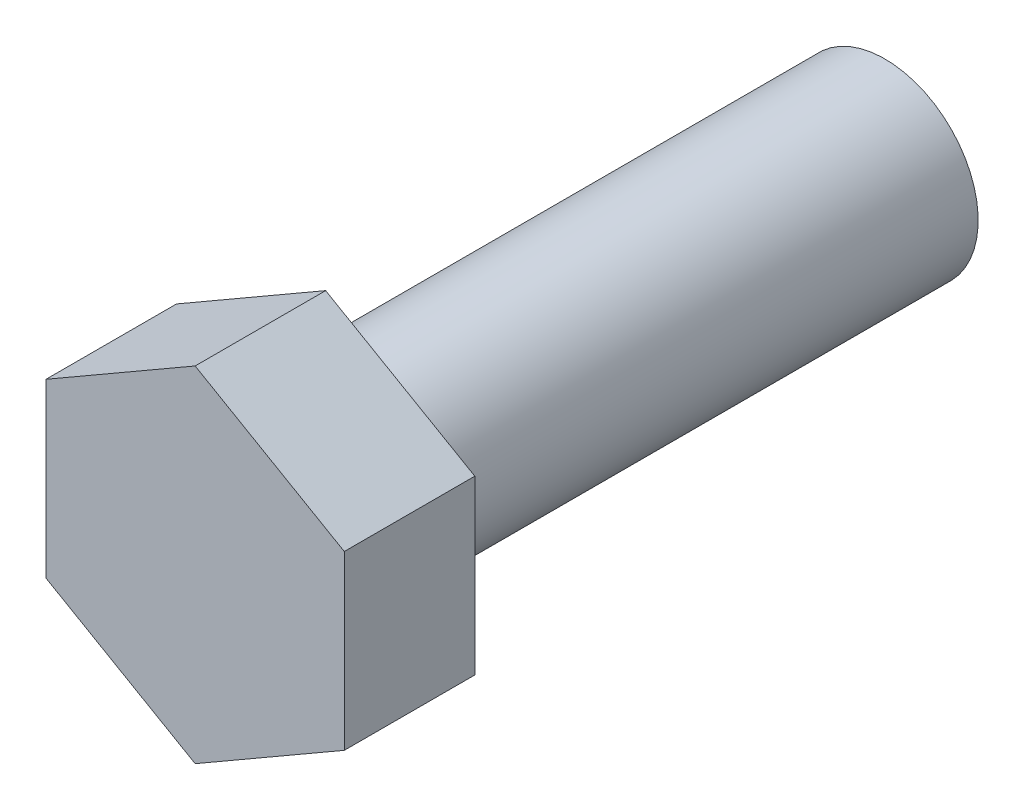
ISO-10303-21;
HEADER;
FILE_DESCRIPTION(('STEP AP214'),'2;1');
FILE_NAME('part.step','',(''),(''),'','','');
FILE_SCHEMA(('AUTOMOTIVE_DESIGN { 1 0 10303 214 1 1 1 1 }'));
ENDSEC;
DATA;
#1=APPLICATION_CONTEXT('core data for automotive mechanical design processes');
#2=APPLICATION_PROTOCOL_DEFINITION('international standard','automotive_design',2000,#1);
#3=PRODUCT_CONTEXT('',#1,'mechanical');
#4=PRODUCT('Part','Part','',(#3));
#5=PRODUCT_RELATED_PRODUCT_CATEGORY('part','',(#4));
#6=PRODUCT_DEFINITION_FORMATION('','',#4);
#7=PRODUCT_DEFINITION_CONTEXT('part definition',#1,'design');
#8=PRODUCT_DEFINITION('design','',#6,#7);
#9=PRODUCT_DEFINITION_SHAPE('','',#8);
#10=(LENGTH_UNIT() NAMED_UNIT(*) SI_UNIT(.MILLI.,.METRE.));
#11=(NAMED_UNIT(*) PLANE_ANGLE_UNIT() SI_UNIT($,.RADIAN.));
#12=(NAMED_UNIT(*) SI_UNIT($,.STERADIAN.) SOLID_ANGLE_UNIT());
#13=UNCERTAINTY_MEASURE_WITH_UNIT(LENGTH_MEASURE(1.E-05),#10,'distance_accuracy_value','');
#14=(GEOMETRIC_REPRESENTATION_CONTEXT(3) GLOBAL_UNCERTAINTY_ASSIGNED_CONTEXT((#13)) GLOBAL_UNIT_ASSIGNED_CONTEXT((#10,
#11,#12)) REPRESENTATION_CONTEXT('',''));
#15=CARTESIAN_POINT('',(0.,0.,0.));
#16=DIRECTION('',(0.,0.,1.));
#17=DIRECTION('',(1.,0.,0.));
#18=AXIS2_PLACEMENT_3D('',#15,#16,#17);
#19=CARTESIAN_POINT('',(0.,-4.618802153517,0.));
#20=DIRECTION('',(0.,0.,1.));
#21=DIRECTION('',(1.,0.,0.));
#22=AXIS2_PLACEMENT_3D('',#19,#20,#21);
#23=PLANE('',#22);
#24=DIRECTION('',(-0.866025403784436,-0.5,0.));
#25=VECTOR('',#24,1.);
#26=CARTESIAN_POINT('',(4.,-2.3094010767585,0.));
#27=LINE('',#26,#25);
#28=CARTESIAN_POINT('',(4.,-2.3094010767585,0.));
#29=VERTEX_POINT('',#28);
#30=CARTESIAN_POINT('',(0.,-4.618802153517,0.));
#31=VERTEX_POINT('',#30);
#32=EDGE_CURVE('E66',#29,#31,#27,.T.);
#33=ORIENTED_EDGE('',*,*,#32,.T.);
#34=DIRECTION('',(0.866025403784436,-0.5,0.));
#35=VECTOR('',#34,1.);
#36=CARTESIAN_POINT('',(-4.,-2.3094010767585,0.));
#37=LINE('',#36,#35);
#38=CARTESIAN_POINT('',(-4.,-2.3094010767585,0.));
#39=VERTEX_POINT('',#38);
#40=EDGE_CURVE('E80',#39,#31,#37,.T.);
#41=ORIENTED_EDGE('',*,*,#40,.F.);
#42=DIRECTION('',(0.,1.,0.));
#43=VECTOR('',#42,1.);
#44=CARTESIAN_POINT('',(-4.,-2.3094010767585,0.));
#45=LINE('',#44,#43);
#46=CARTESIAN_POINT('',(-4.,2.3094010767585,0.));
#47=VERTEX_POINT('',#46);
#48=EDGE_CURVE('E87',#39,#47,#45,.T.);
#49=ORIENTED_EDGE('',*,*,#48,.T.);
#50=DIRECTION('',(0.86602540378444,0.5,0.));
#51=VECTOR('',#50,1.);
#52=CARTESIAN_POINT('',(-4.,2.3094010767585,0.));
#53=LINE('',#52,#51);
#54=CARTESIAN_POINT('',(0.,4.618802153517,0.));
#55=VERTEX_POINT('',#54);
#56=EDGE_CURVE('E89',#47,#55,#53,.T.);
#57=ORIENTED_EDGE('',*,*,#56,.T.);
#58=DIRECTION('',(-0.86602540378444,0.5,0.));
#59=VECTOR('',#58,1.);
#60=CARTESIAN_POINT('',(4.,2.3094010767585,0.));
#61=LINE('',#60,#59);
#62=CARTESIAN_POINT('',(4.,2.3094010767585,0.));
#63=VERTEX_POINT('',#62);
#64=EDGE_CURVE('E114',#63,#55,#61,.T.);
#65=ORIENTED_EDGE('',*,*,#64,.F.);
#66=DIRECTION('',(0.,1.,0.));
#67=VECTOR('',#66,1.);
#68=CARTESIAN_POINT('',(4.,-2.3094010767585,0.));
#69=LINE('',#68,#67);
#70=EDGE_CURVE('E83',#29,#63,#69,.T.);
#71=ORIENTED_EDGE('',*,*,#70,.F.);
#72=EDGE_LOOP('',(#33,#41,#49,#57,#65,#71));
#73=FACE_BOUND('',#72,.T.);
#74=CARTESIAN_POINT('',(0.,0.,0.));
#75=DIRECTION('',(0.,0.,-1.));
#76=DIRECTION('',(-1.,0.,0.));
#77=AXIS2_PLACEMENT_3D('',#74,#75,#76);
#78=CIRCLE('',#77,2.5);
#79=CARTESIAN_POINT('',(-2.5,0.,0.));
#80=VERTEX_POINT('',#79);
#81=EDGE_CURVE('E84',#80,#80,#78,.T.);
#82=ORIENTED_EDGE('',*,*,#81,.F.);
#83=EDGE_LOOP('',(#82));
#84=FACE_BOUND('',#83,.T.);
#85=ADVANCED_FACE('F14',(#73,#84),#23,.F.);
#86=CARTESIAN_POINT('',(4.,-2.3094010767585,3.5));
#87=DIRECTION('',(0.5,-0.866025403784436,0.));
#88=DIRECTION('',(0.866025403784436,0.5,0.));
#89=AXIS2_PLACEMENT_3D('',#86,#87,#88);
#90=PLANE('',#89);
#91=DIRECTION('',(0.,0.,-1.));
#92=VECTOR('',#91,1.);
#93=CARTESIAN_POINT('',(4.,-2.3094010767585,3.5));
#94=LINE('',#93,#92);
#95=CARTESIAN_POINT('',(4.,-2.3094010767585,3.5));
#96=VERTEX_POINT('',#95);
#97=EDGE_CURVE('E9',#96,#29,#94,.T.);
#98=ORIENTED_EDGE('',*,*,#97,.F.);
#99=DIRECTION('',(-0.866025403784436,-0.5,0.));
#100=VECTOR('',#99,1.);
#101=CARTESIAN_POINT('',(4.,-2.3094010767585,3.5));
#102=LINE('',#101,#100);
#103=CARTESIAN_POINT('',(0.,-4.618802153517,3.5));
#104=VERTEX_POINT('',#103);
#105=EDGE_CURVE('E68',#96,#104,#102,.T.);
#106=ORIENTED_EDGE('',*,*,#105,.T.);
#107=DIRECTION('',(0.,0.,-1.));
#108=VECTOR('',#107,1.);
#109=CARTESIAN_POINT('',(0.,-4.618802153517,3.5));
#110=LINE('',#109,#108);
#111=EDGE_CURVE('E63',#104,#31,#110,.T.);
#112=ORIENTED_EDGE('',*,*,#111,.T.);
#113=ORIENTED_EDGE('',*,*,#32,.F.);
#114=EDGE_LOOP('',(#98,#106,#112,#113));
#115=FACE_BOUND('',#114,.T.);
#116=ADVANCED_FACE('F65',(#115),#90,.T.);
#117=CARTESIAN_POINT('',(4.,-2.3094010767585,3.5));
#118=DIRECTION('',(-1.,0.,0.));
#119=DIRECTION('',(0.,0.,1.));
#120=AXIS2_PLACEMENT_3D('',#117,#118,#119);
#121=PLANE('',#120);
#122=DIRECTION('',(0.,0.,-1.));
#123=VECTOR('',#122,1.);
#124=CARTESIAN_POINT('',(4.,2.3094010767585,3.5));
#125=LINE('',#124,#123);
#126=CARTESIAN_POINT('',(4.,2.3094010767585,3.5));
#127=VERTEX_POINT('',#126);
#128=EDGE_CURVE('E22',#127,#63,#125,.T.);
#129=ORIENTED_EDGE('',*,*,#128,.F.);
#130=DIRECTION('',(0.,1.,0.));
#131=VECTOR('',#130,1.);
#132=CARTESIAN_POINT('',(4.,-2.3094010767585,3.5));
#133=LINE('',#132,#131);
#134=EDGE_CURVE('E74',#96,#127,#133,.T.);
#135=ORIENTED_EDGE('',*,*,#134,.F.);
#136=ORIENTED_EDGE('',*,*,#97,.T.);
#137=ORIENTED_EDGE('',*,*,#70,.T.);
#138=EDGE_LOOP('',(#129,#135,#136,#137));
#139=FACE_BOUND('',#138,.T.);
#140=ADVANCED_FACE('F118',(#139),#121,.F.);
#141=CARTESIAN_POINT('',(4.,2.3094010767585,3.5));
#142=DIRECTION('',(-0.5,-0.86602540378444,0.));
#143=DIRECTION('',(0.86602540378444,-0.5,0.));
#144=AXIS2_PLACEMENT_3D('',#141,#142,#143);
#145=PLANE('',#144);
#146=DIRECTION('',(0.,0.,-1.));
#147=VECTOR('',#146,1.);
#148=CARTESIAN_POINT('',(0.,4.618802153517,3.5));
#149=LINE('',#148,#147);
#150=CARTESIAN_POINT('',(0.,4.618802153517,3.5));
#151=VERTEX_POINT('',#150);
#152=EDGE_CURVE('E110',#151,#55,#149,.T.);
#153=ORIENTED_EDGE('',*,*,#152,.F.);
#154=DIRECTION('',(-0.86602540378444,0.5,0.));
#155=VECTOR('',#154,1.);
#156=CARTESIAN_POINT('',(4.,2.3094010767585,3.5));
#157=LINE('',#156,#155);
#158=EDGE_CURVE('E95',#127,#151,#157,.T.);
#159=ORIENTED_EDGE('',*,*,#158,.F.);
#160=ORIENTED_EDGE('',*,*,#128,.T.);
#161=ORIENTED_EDGE('',*,*,#64,.T.);
#162=EDGE_LOOP('',(#153,#159,#160,#161));
#163=FACE_BOUND('',#162,.T.);
#164=ADVANCED_FACE('F113',(#163),#145,.F.);
#165=CARTESIAN_POINT('',(-4.,2.3094010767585,3.5));
#166=DIRECTION('',(-0.5,0.86602540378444,0.));
#167=DIRECTION('',(-0.86602540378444,-0.5,0.));
#168=AXIS2_PLACEMENT_3D('',#165,#166,#167);
#169=PLANE('',#168);
#170=DIRECTION('',(0.,0.,-1.));
#171=VECTOR('',#170,1.);
#172=CARTESIAN_POINT('',(-4.,2.3094010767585,3.5));
#173=LINE('',#172,#171);
#174=CARTESIAN_POINT('',(-4.,2.3094010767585,3.5));
#175=VERTEX_POINT('',#174);
#176=EDGE_CURVE('E108',#175,#47,#173,.T.);
#177=ORIENTED_EDGE('',*,*,#176,.F.);
#178=DIRECTION('',(0.86602540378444,0.5,0.));
#179=VECTOR('',#178,1.);
#180=CARTESIAN_POINT('',(-4.,2.3094010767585,3.5));
#181=LINE('',#180,#179);
#182=EDGE_CURVE('E98',#175,#151,#181,.T.);
#183=ORIENTED_EDGE('',*,*,#182,.T.);
#184=ORIENTED_EDGE('',*,*,#152,.T.);
#185=ORIENTED_EDGE('',*,*,#56,.F.);
#186=EDGE_LOOP('',(#177,#183,#184,#185));
#187=FACE_BOUND('',#186,.T.);
#188=ADVANCED_FACE('F148',(#187),#169,.T.);
#189=CARTESIAN_POINT('',(-4.,-2.3094010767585,3.5));
#190=DIRECTION('',(-1.,0.,0.));
#191=DIRECTION('',(0.,0.,1.));
#192=AXIS2_PLACEMENT_3D('',#189,#190,#191);
#193=PLANE('',#192);
#194=DIRECTION('',(0.,0.,-1.));
#195=VECTOR('',#194,1.);
#196=CARTESIAN_POINT('',(-4.,-2.3094010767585,3.5));
#197=LINE('',#196,#195);
#198=CARTESIAN_POINT('',(-4.,-2.3094010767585,3.5));
#199=VERTEX_POINT('',#198);
#200=EDGE_CURVE('E73',#199,#39,#197,.T.);
#201=ORIENTED_EDGE('',*,*,#200,.F.);
#202=DIRECTION('',(0.,1.,0.));
#203=VECTOR('',#202,1.);
#204=CARTESIAN_POINT('',(-4.,-2.3094010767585,3.5));
#205=LINE('',#204,#203);
#206=EDGE_CURVE('E101',#199,#175,#205,.T.);
#207=ORIENTED_EDGE('',*,*,#206,.T.);
#208=ORIENTED_EDGE('',*,*,#176,.T.);
#209=ORIENTED_EDGE('',*,*,#48,.F.);
#210=EDGE_LOOP('',(#201,#207,#208,#209));
#211=FACE_BOUND('',#210,.T.);
#212=ADVANCED_FACE('F142',(#211),#193,.T.);
#213=CARTESIAN_POINT('',(-4.,-2.3094010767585,3.5));
#214=DIRECTION('',(0.5,0.866025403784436,0.));
#215=DIRECTION('',(-0.866025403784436,0.5,0.));
#216=AXIS2_PLACEMENT_3D('',#213,#214,#215);
#217=PLANE('',#216);
#218=DIRECTION('',(0.866025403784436,-0.5,0.));
#219=VECTOR('',#218,1.);
#220=CARTESIAN_POINT('',(-4.,-2.3094010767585,3.5));
#221=LINE('',#220,#219);
#222=EDGE_CURVE('E104',#199,#104,#221,.T.);
#223=ORIENTED_EDGE('',*,*,#222,.F.);
#224=ORIENTED_EDGE('',*,*,#200,.T.);
#225=ORIENTED_EDGE('',*,*,#40,.T.);
#226=ORIENTED_EDGE('',*,*,#111,.F.);
#227=EDGE_LOOP('',(#223,#224,#225,#226));
#228=FACE_BOUND('',#227,.T.);
#229=ADVANCED_FACE('F86',(#228),#217,.F.);
#230=CARTESIAN_POINT('',(0.,-4.618802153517,3.5));
#231=DIRECTION('',(0.,0.,1.));
#232=DIRECTION('',(1.,0.,0.));
#233=AXIS2_PLACEMENT_3D('',#230,#231,#232);
#234=PLANE('',#233);
#235=ORIENTED_EDGE('',*,*,#105,.F.);
#236=ORIENTED_EDGE('',*,*,#134,.T.);
#237=ORIENTED_EDGE('',*,*,#158,.T.);
#238=ORIENTED_EDGE('',*,*,#182,.F.);
#239=ORIENTED_EDGE('',*,*,#206,.F.);
#240=ORIENTED_EDGE('',*,*,#222,.T.);
#241=EDGE_LOOP('',(#235,#236,#237,#238,#239,#240));
#242=FACE_BOUND('',#241,.T.);
#243=ADVANCED_FACE('F139',(#242),#234,.T.);
#244=CARTESIAN_POINT('',(0.,0.,0.));
#245=DIRECTION('',(0.,0.,-1.));
#246=DIRECTION('',(-1.,0.,0.));
#247=AXIS2_PLACEMENT_3D('',#244,#245,#246);
#248=CYLINDRICAL_SURFACE('',#247,2.5);
#249=ORIENTED_EDGE('',*,*,#81,.T.);
#250=EDGE_LOOP('',(#249));
#251=FACE_BOUND('',#250,.T.);
#252=CARTESIAN_POINT('',(0.,0.,-15.));
#253=DIRECTION('',(0.,0.,-1.));
#254=DIRECTION('',(-1.,0.,0.));
#255=AXIS2_PLACEMENT_3D('',#252,#253,#254);
#256=CIRCLE('',#255,2.5);
#257=CARTESIAN_POINT('',(-2.5,0.,-15.));
#258=VERTEX_POINT('',#257);
#259=EDGE_CURVE('E121',#258,#258,#256,.T.);
#260=ORIENTED_EDGE('',*,*,#259,.F.);
#261=EDGE_LOOP('',(#260));
#262=FACE_BOUND('',#261,.T.);
#263=ADVANCED_FACE('F127',(#251,#262),#248,.T.);
#264=CARTESIAN_POINT('',(1.75,0.,-15.));
#265=DIRECTION('',(0.,0.,-1.));
#266=DIRECTION('',(-1.,0.,0.));
#267=AXIS2_PLACEMENT_3D('',#264,#265,#266);
#268=PLANE('',#267);
#269=ORIENTED_EDGE('',*,*,#259,.T.);
#270=EDGE_LOOP('',(#269));
#271=FACE_BOUND('',#270,.T.);
#272=ADVANCED_FACE('F16',(#271),#268,.T.);
#273=CLOSED_SHELL('',(#85,#116,#140,#164,#188,#212,#229,#243,#263,#272));
#274=MANIFOLD_SOLID_BREP('B1',#273);
#275=ADVANCED_BREP_SHAPE_REPRESENTATION('',(#18,#274),#14);
#276=SHAPE_DEFINITION_REPRESENTATION(#9,#275);
ENDSEC;
END-ISO-10303-21;
